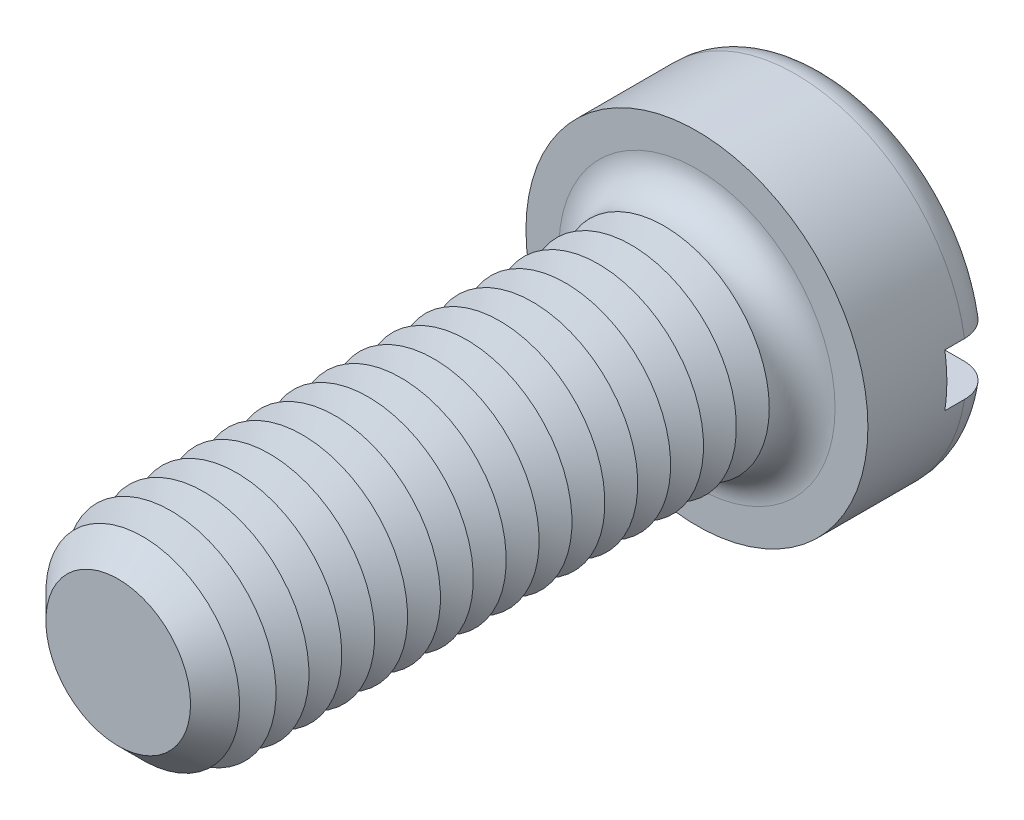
ISO-10303-21;
HEADER;
FILE_DESCRIPTION(('STEP AP214'),'2;1');
FILE_NAME('part.step','',(''),(''),'','','');
FILE_SCHEMA(('AUTOMOTIVE_DESIGN { 1 0 10303 214 1 1 1 1 }'));
ENDSEC;
DATA;
#1=APPLICATION_CONTEXT('core data for automotive mechanical design processes');
#2=APPLICATION_PROTOCOL_DEFINITION('international standard','automotive_design',2000,#1);
#3=PRODUCT_CONTEXT('',#1,'mechanical');
#4=PRODUCT('Part','Part','',(#3));
#5=PRODUCT_RELATED_PRODUCT_CATEGORY('part','',(#4));
#6=PRODUCT_DEFINITION_FORMATION('','',#4);
#7=PRODUCT_DEFINITION_CONTEXT('part definition',#1,'design');
#8=PRODUCT_DEFINITION('design','',#6,#7);
#9=PRODUCT_DEFINITION_SHAPE('','',#8);
#10=(LENGTH_UNIT() NAMED_UNIT(*) SI_UNIT(.MILLI.,.METRE.));
#11=(NAMED_UNIT(*) PLANE_ANGLE_UNIT() SI_UNIT($,.RADIAN.));
#12=(NAMED_UNIT(*) SI_UNIT($,.STERADIAN.) SOLID_ANGLE_UNIT());
#13=UNCERTAINTY_MEASURE_WITH_UNIT(LENGTH_MEASURE(1.E-05),#10,'distance_accuracy_value','');
#14=(GEOMETRIC_REPRESENTATION_CONTEXT(3) GLOBAL_UNCERTAINTY_ASSIGNED_CONTEXT((#13)) GLOBAL_UNIT_ASSIGNED_CONTEXT((#10,
#11,#12)) REPRESENTATION_CONTEXT('',''));
#15=CARTESIAN_POINT('',(0.,0.,0.));
#16=DIRECTION('',(0.,0.,1.));
#17=DIRECTION('',(1.,0.,0.));
#18=AXIS2_PLACEMENT_3D('',#15,#16,#17);
#19=CARTESIAN_POINT('',(0.,0.,-5.));
#20=DIRECTION('',(0.,0.,1.));
#21=DIRECTION('',(1.,0.,0.));
#22=AXIS2_PLACEMENT_3D('',#19,#20,#21);
#23=PLANE('',#22);
#24=CARTESIAN_POINT('',(0.,0.,-5.));
#25=DIRECTION('',(0.,0.,1.));
#26=DIRECTION('',(1.,0.,0.));
#27=AXIS2_PLACEMENT_3D('',#24,#25,#26);
#28=CIRCLE('',#27,5.25);
#29=CARTESIAN_POINT('',(-5.15388203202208,1.,-5.));
#30=VERTEX_POINT('',#29);
#31=CARTESIAN_POINT('',(5.15388203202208,1.,-5.));
#32=VERTEX_POINT('',#31);
#33=EDGE_CURVE('E116',#30,#32,#28,.F.);
#34=ORIENTED_EDGE('',*,*,#33,.T.);
#35=DIRECTION('',(1.,0.,0.));
#36=VECTOR('',#35,1.);
#37=CARTESIAN_POINT('',(-6.5,1.,-5.));
#38=LINE('',#37,#36);
#39=EDGE_CURVE('E111',#30,#32,#38,.T.);
#40=ORIENTED_EDGE('',*,*,#39,.F.);
#41=EDGE_LOOP('',(#34,#40));
#42=FACE_BOUND('',#41,.T.);
#43=ADVANCED_FACE('F39',(#42),#23,.F.);
#44=CARTESIAN_POINT('',(0.,0.,-3.75));
#45=DIRECTION('',(0.,0.,1.));
#46=DIRECTION('',(1.,0.,0.));
#47=AXIS2_PLACEMENT_3D('',#44,#45,#46);
#48=TOROIDAL_SURFACE('',#47,5.25,1.25);
#49=CARTESIAN_POINT('',(-6.04655789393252,1.,-4.63904490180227));
#50=CARTESIAN_POINT('',(-5.99546860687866,1.,-4.68885774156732));
#51=CARTESIAN_POINT('',(-5.94008472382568,1.,-4.73434760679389));
#52=CARTESIAN_POINT('',(-5.8223927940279,1.,-4.81538052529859));
#53=CARTESIAN_POINT('',(-5.7600753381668,1.,-4.85090982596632));
#54=CARTESIAN_POINT('',(-5.63044351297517,1.,-4.91100606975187));
#55=CARTESIAN_POINT('',(-5.56313479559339,1.,-4.93558519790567));
#56=CARTESIAN_POINT('',(-5.42539577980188,1.,-4.97322457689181));
#57=CARTESIAN_POINT('',(-5.35496625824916,1.,-4.98628767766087));
#58=CARTESIAN_POINT('',(-5.21212635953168,1.,-5.00070478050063));
#59=CARTESIAN_POINT('',(-5.13970265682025,1.,-5.00192674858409));
#60=CARTESIAN_POINT('',(-4.99565121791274,1.,-4.99234085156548));
#61=CARTESIAN_POINT('',(-4.92402357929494,1.,-4.98153152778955));
#62=CARTESIAN_POINT('',(-4.78274786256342,1.,-4.94801424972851));
#63=CARTESIAN_POINT('',(-4.71313137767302,1.,-4.92517296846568));
#64=CARTESIAN_POINT('',(-4.57871041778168,1.,-4.86813760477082));
#65=CARTESIAN_POINT('',(-4.51390612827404,1.,-4.83394308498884));
#66=CARTESIAN_POINT('',(-4.39095493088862,1.,-4.75508341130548));
#67=CARTESIAN_POINT('',(-4.33281197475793,1.,-4.7104120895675));
#68=CARTESIAN_POINT('',(-4.22499800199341,1.,-4.61179869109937));
#69=CARTESIAN_POINT('',(-4.17532640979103,1.,-4.55785724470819));
#70=CARTESIAN_POINT('',(-4.08677450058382,1.,-4.4431082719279));
#71=CARTESIAN_POINT('',(-4.0477350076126,1.,-4.38242369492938));
#72=CARTESIAN_POINT('',(-3.98074296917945,1.,-4.25521412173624));
#73=CARTESIAN_POINT('',(-3.95278836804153,1.,-4.18869021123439));
#74=CARTESIAN_POINT('',(-3.90959497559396,1.,-4.0537026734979));
#75=CARTESIAN_POINT('',(-3.89401985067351,1.,-3.98534663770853));
#76=CARTESIAN_POINT('',(-3.8748586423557,1.,-3.84697740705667));
#77=CARTESIAN_POINT('',(-3.87127067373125,1.,-3.7769644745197));
#78=CARTESIAN_POINT('',(-3.8761573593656,1.,-3.63892215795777));
#79=CARTESIAN_POINT('',(-3.88436651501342,1.,-3.57088319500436));
#80=CARTESIAN_POINT('',(-3.91207743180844,1.,-3.43714958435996));
#81=CARTESIAN_POINT('',(-3.93157911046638,1.,-3.37145491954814));
#82=CARTESIAN_POINT('',(-3.98125045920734,1.,-3.24411474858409));
#83=CARTESIAN_POINT('',(-4.01143761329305,1.,-3.18247607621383));
#84=CARTESIAN_POINT('',(-4.08150210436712,1.,-3.064981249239));
#85=CARTESIAN_POINT('',(-4.12138048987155,1.,-3.0091257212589));
#86=CARTESIAN_POINT('',(-4.2106718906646,1.,-2.90336353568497));
#87=CARTESIAN_POINT('',(-4.26028693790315,1.,-2.85362751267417));
#88=CARTESIAN_POINT('',(-4.36696587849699,1.,-2.76291710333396));
#89=CARTESIAN_POINT('',(-4.42403082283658,1.,-2.72194395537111));
#90=CARTESIAN_POINT('',(-4.54567957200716,1.,-2.64877280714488));
#91=CARTESIAN_POINT('',(-4.61042643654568,1.,-2.61684571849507));
#92=CARTESIAN_POINT('',(-4.74430563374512,1.,-2.56412359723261));
#93=CARTESIAN_POINT('',(-4.81343838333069,1.,-2.54332962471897));
#94=CARTESIAN_POINT('',(-4.95527237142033,1.,-2.51320471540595));
#95=CARTESIAN_POINT('',(-5.0280120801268,1.,-2.50405449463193));
#96=CARTESIAN_POINT('',(-5.17399775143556,1.,-2.49810126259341));
#97=CARTESIAN_POINT('',(-5.24724372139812,1.,-2.50129843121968));
#98=CARTESIAN_POINT('',(-5.3921014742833,1.,-2.52000776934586));
#99=CARTESIAN_POINT('',(-5.4637142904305,1.,-2.53551191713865));
#100=CARTESIAN_POINT('',(-5.60326680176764,1.,-2.57846304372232));
#101=CARTESIAN_POINT('',(-5.67120668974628,1.,-2.60590939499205));
#102=CARTESIAN_POINT('',(-5.80064060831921,1.,-2.67164926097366));
#103=CARTESIAN_POINT('',(-5.862199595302,1.,-2.7098148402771));
#104=CARTESIAN_POINT('',(-5.9779079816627,1.,-2.79608690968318));
#105=CARTESIAN_POINT('',(-6.03205795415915,1.,-2.84419263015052));
#106=CARTESIAN_POINT('',(-6.13055119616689,1.,-2.94820522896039));
#107=CARTESIAN_POINT('',(-6.17502887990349,1.,-3.00398483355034));
#108=CARTESIAN_POINT('',(-6.25384180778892,1.,-3.12230113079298));
#109=CARTESIAN_POINT('',(-6.28817779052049,1.,-3.18483733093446));
#110=CARTESIAN_POINT('',(-6.34527986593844,1.,-3.31401726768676));
#111=CARTESIAN_POINT('',(-6.36818984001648,1.,-3.38059742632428));
#112=CARTESIAN_POINT('',(-6.40240470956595,1.,-3.5166725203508));
#113=CARTESIAN_POINT('',(-6.41371067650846,1.,-3.58616718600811));
#114=CARTESIAN_POINT('',(-6.42433240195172,1.,-3.72550026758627));
#115=CARTESIAN_POINT('',(-6.4237441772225,1.,-3.79533138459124));
#116=CARTESIAN_POINT('',(-6.41082814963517,1.,-3.93391789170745));
#117=CARTESIAN_POINT('',(-6.39849757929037,1.,-4.00267302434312));
#118=CARTESIAN_POINT('',(-6.36249191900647,1.,-4.13704597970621));
#119=CARTESIAN_POINT('',(-6.33883072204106,1.,-4.20266753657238));
#120=CARTESIAN_POINT('',(-6.28088769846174,1.,-4.32897165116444));
#121=CARTESIAN_POINT('',(-6.24661890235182,1.,-4.38966015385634));
#122=CARTESIAN_POINT('',(-6.18404039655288,1.,-4.48163773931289));
#123=CARTESIAN_POINT('',(-6.15876600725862,1.,-4.51503333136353));
#124=CARTESIAN_POINT('',(-6.10500607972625,1.,-4.5791298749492));
#125=CARTESIAN_POINT('',(-6.07652056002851,1.,-4.60983084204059));
#126=CARTESIAN_POINT('',(-6.04655789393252,1.,-4.63904490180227));
#127=B_SPLINE_CURVE_WITH_KNOTS('',3,(#49,#50,#51,#52,#53,#54,#55,#56,#57,#58,#59,#60,#61,#62,
#63,#64,#65,#66,#67,#68,#69,#70,#71,#72,#73,#74,#75,#76,#77,#78,#79,#80,#81,#82,#83,#84,#85,#86,
#87,#88,#89,#90,#91,#92,#93,#94,#95,#96,#97,#98,#99,#100,#101,#102,#103,#104,#105,#106,#107,
#108,#109,#110,#111,#112,#113,#114,#115,#116,#117,#118,#119,#120,#121,#122,#123,#124,#125,#126),
.UNSPECIFIED.,.T.,.F.,(4,2,2,2,2,2,2,2,2,2,2,2,2,2,2,2,2,2,2,2,2,2,2,2,2,2,2,2,2,2,2,2,2,2,2,2,
2,2,4),(0.,0.213907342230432,0.428108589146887,0.642070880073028,0.855980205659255,
1.07227200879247,1.28859003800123,1.50735715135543,1.72613269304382,1.94503735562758,
2.16392713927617,2.37933295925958,2.59469881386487,2.80399176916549,3.01325180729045,
3.2178754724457,3.42249764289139,3.62745618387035,3.83243690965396,4.04223444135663,
4.25206160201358,4.46763253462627,4.68322399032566,4.90212226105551,5.12102372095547,
5.33978261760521,5.55853002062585,5.77477015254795,5.99099354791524,6.20398686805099,
6.41696467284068,6.62718821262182,6.83739233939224,7.0459002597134,7.25445733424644,
7.46275934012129,7.67080647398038,7.79625882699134,7.92171045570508),.UNSPECIFIED.);
#128=CARTESIAN_POINT('',(-6.42261628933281,1.,-3.74999999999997));
#129=VERTEX_POINT('',#128);
#130=EDGE_CURVE('E312',#129,#30,#127,.T.);
#131=ORIENTED_EDGE('',*,*,#130,.F.);
#132=CARTESIAN_POINT('',(0.,0.,-3.75));
#133=DIRECTION('',(0.,0.,1.));
#134=DIRECTION('',(1.,0.,0.));
#135=AXIS2_PLACEMENT_3D('',#132,#133,#134);
#136=CIRCLE('',#135,6.5);
#137=CARTESIAN_POINT('',(6.42261628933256,1.,-3.75));
#138=VERTEX_POINT('',#137);
#139=EDGE_CURVE('E124',#138,#129,#136,.T.);
#140=ORIENTED_EDGE('',*,*,#139,.F.);
#141=CARTESIAN_POINT('',(4.06944999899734,1.,-4.4133199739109));
#142=CARTESIAN_POINT('',(4.10828271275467,1.,-4.47354709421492));
#143=CARTESIAN_POINT('',(4.15233880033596,1.,-4.53047894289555));
#144=CARTESIAN_POINT('',(4.24946916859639,1.,-4.63614530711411));
#145=CARTESIAN_POINT('',(4.3025574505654,1.,-4.68486685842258));
#146=CARTESIAN_POINT('',(4.41603250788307,1.,-4.77271114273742));
#147=CARTESIAN_POINT('',(4.47640839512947,1.,-4.8118479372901));
#148=CARTESIAN_POINT('',(4.60277035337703,1.,-4.87959878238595));
#149=CARTESIAN_POINT('',(4.66875480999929,1.,-4.90821584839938));
#150=CARTESIAN_POINT('',(4.80558589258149,1.,-4.95456537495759));
#151=CARTESIAN_POINT('',(4.87649196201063,1.,-4.97212253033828));
#152=CARTESIAN_POINT('',(5.02024710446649,1.,-4.99514979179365));
#153=CARTESIAN_POINT('',(5.09309636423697,1.,-5.00061873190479));
#154=CARTESIAN_POINT('',(5.23902872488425,1.,-4.99926689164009));
#155=CARTESIAN_POINT('',(5.31211131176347,1.,-4.99238812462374));
#156=CARTESIAN_POINT('',(5.45605806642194,1.,-4.96635140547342));
#157=CARTESIAN_POINT('',(5.52692231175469,1.,-4.94719388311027));
#158=CARTESIAN_POINT('',(5.66376170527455,1.,-4.89728421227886));
#159=CARTESIAN_POINT('',(5.72977335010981,1.,-4.86663219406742));
#160=CARTESIAN_POINT('',(5.85560715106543,1.,-4.79452334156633));
#161=CARTESIAN_POINT('',(5.91542977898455,1.,-4.7530673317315));
#162=CARTESIAN_POINT('',(6.02626022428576,1.,-4.66116821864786));
#163=CARTESIAN_POINT('',(6.07738307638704,1.,-4.6108638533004));
#164=CARTESIAN_POINT('',(6.17030947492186,1.,-4.50227823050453));
#165=CARTESIAN_POINT('',(6.2121137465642,1.,-4.44399759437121));
#166=CARTESIAN_POINT('',(6.28460268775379,1.,-4.32200305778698));
#167=CARTESIAN_POINT('',(6.31543589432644,1.,-4.2583773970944));
#168=CARTESIAN_POINT('',(6.36586009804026,1.,-4.12681721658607));
#169=CARTESIAN_POINT('',(6.38545178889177,1.,-4.0588829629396));
#170=CARTESIAN_POINT('',(6.41265760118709,1.,-3.92136007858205));
#171=CARTESIAN_POINT('',(6.42038873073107,1.,-3.85179457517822));
#172=CARTESIAN_POINT('',(6.42401070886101,1.,-3.7123569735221));
#173=CARTESIAN_POINT('',(6.41990193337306,1.,-3.64248488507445));
#174=CARTESIAN_POINT('',(6.40000894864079,1.,-3.50470871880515));
#175=CARTESIAN_POINT('',(6.38427119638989,1.,-3.43679792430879));
#176=CARTESIAN_POINT('',(6.34164491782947,1.,-3.30457296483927));
#177=CARTESIAN_POINT('',(6.31475638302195,1.,-3.24025880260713));
#178=CARTESIAN_POINT('',(6.2505455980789,1.,-3.11686791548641));
#179=CARTESIAN_POINT('',(6.21319759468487,1.,-3.05780459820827));
#180=CARTESIAN_POINT('',(6.12919411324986,1.,-2.94671919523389));
#181=CARTESIAN_POINT('',(6.08253833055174,1.,-2.89469734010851));
#182=CARTESIAN_POINT('',(5.98083387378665,1.,-2.79868150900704));
#183=CARTESIAN_POINT('',(5.92571704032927,1.,-2.75475975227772));
#184=CARTESIAN_POINT('',(5.80897194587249,1.,-2.67665277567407));
#185=CARTESIAN_POINT('',(5.74734329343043,1.,-2.64246814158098));
#186=CARTESIAN_POINT('',(5.6184644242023,1.,-2.58431810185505));
#187=CARTESIAN_POINT('',(5.55115102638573,1.,-2.56049275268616));
#188=CARTESIAN_POINT('',(5.41351272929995,1.,-2.52429868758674));
#189=CARTESIAN_POINT('',(5.34318759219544,1.,-2.51193087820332));
#190=CARTESIAN_POINT('',(5.20041507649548,1.,-2.49882112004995));
#191=CARTESIAN_POINT('',(5.12795169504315,1.,-2.49825332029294));
#192=CARTESIAN_POINT('',(4.98393373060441,1.,-2.50914771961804));
#193=CARTESIAN_POINT('',(4.91237921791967,1.,-2.52061084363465));
#194=CARTESIAN_POINT('',(4.77137358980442,1.,-2.55542281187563));
#195=CARTESIAN_POINT('',(4.70195472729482,1.,-2.57890245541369));
#196=CARTESIAN_POINT('',(4.56803538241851,1.,-2.63717701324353));
#197=CARTESIAN_POINT('',(4.50353509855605,1.,-2.67197238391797));
#198=CARTESIAN_POINT('',(4.38131858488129,1.,-2.7519648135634));
#199=CARTESIAN_POINT('',(4.32360365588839,1.,-2.79716386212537));
#200=CARTESIAN_POINT('',(4.21673400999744,1.,-2.89675634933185));
#201=CARTESIAN_POINT('',(4.16757871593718,1.,-2.95114916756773));
#202=CARTESIAN_POINT('',(4.08014713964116,1.,-3.06667703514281));
#203=CARTESIAN_POINT('',(4.04170608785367,1.,-3.12768727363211));
#204=CARTESIAN_POINT('',(3.97596192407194,1.,-3.25543782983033));
#205=CARTESIAN_POINT('',(3.94865624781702,1.,-3.32217682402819));
#206=CARTESIAN_POINT('',(3.9067737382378,1.,-3.45745603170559));
#207=CARTESIAN_POINT('',(3.89185707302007,1.,-3.52589108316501));
#208=CARTESIAN_POINT('',(3.87400755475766,1.,-3.66432360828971));
#209=CARTESIAN_POINT('',(3.87107601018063,1.,-3.73432125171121));
#210=CARTESIAN_POINT('',(3.8772387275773,1.,-3.87228267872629));
#211=CARTESIAN_POINT('',(3.88607933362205,1.,-3.94025811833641));
#212=CARTESIAN_POINT('',(3.91502769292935,1.,-4.07370133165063));
#213=CARTESIAN_POINT('',(3.93512131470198,1.,-4.1391721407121));
#214=CARTESIAN_POINT('',(3.9752037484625,1.,-4.23926719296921));
#215=CARTESIAN_POINT('',(3.99171171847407,1.,-4.27532618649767));
#216=CARTESIAN_POINT('',(4.02809737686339,1.,-4.34569933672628));
#217=CARTESIAN_POINT('',(4.04797497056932,1.,-4.3800135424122));
#218=CARTESIAN_POINT('',(4.06944999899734,1.,-4.4133199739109));
#219=B_SPLINE_CURVE_WITH_KNOTS('',3,(#141,#142,#143,#144,#145,#146,#147,#148,#149,#150,#151,
#152,#153,#154,#155,#156,#157,#158,#159,#160,#161,#162,#163,#164,#165,#166,#167,#168,#169,#170,
#171,#172,#173,#174,#175,#176,#177,#178,#179,#180,#181,#182,#183,#184,#185,#186,#187,#188,#189,
#190,#191,#192,#193,#194,#195,#196,#197,#198,#199,#200,#201,#202,#203,#204,#205,#206,#207,#208,
#209,#210,#211,#212,#213,#214,#215,#216,#217,#218),.UNSPECIFIED.,.T.,.F.,(4,2,2,2,2,2,2,2,2,2,2,
2,2,2,2,2,2,2,2,2,2,2,2,2,2,2,2,2,2,2,2,2,2,2,2,2,2,2,4),(0.,0.214833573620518,
0.430003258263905,0.644855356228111,0.859645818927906,1.0777603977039,1.29589601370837,
1.51505870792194,1.73421373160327,1.95150241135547,2.16877451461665,2.38290237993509,
2.59701357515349,2.8081044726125,3.01918234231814,3.22816416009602,3.43713934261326,
3.64528416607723,3.85342914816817,4.06209119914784,4.27076008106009,4.48120788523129,
4.69166834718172,4.90489186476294,5.11813225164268,5.33451752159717,5.55091942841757,
5.76972860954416,5.98854661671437,6.20740650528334,6.42625163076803,6.64151774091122,
6.85673425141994,7.0658317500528,7.27495207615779,7.47963858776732,7.68406862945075,
7.80287790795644,7.92168384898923),.UNSPECIFIED.);
#220=EDGE_CURVE('E314',#32,#138,#219,.T.);
#221=ORIENTED_EDGE('',*,*,#220,.F.);
#222=ORIENTED_EDGE('',*,*,#33,.F.);
#223=EDGE_LOOP('',(#131,#140,#221,#222));
#224=FACE_BOUND('',#223,.T.);
#225=ADVANCED_FACE('F296',(#224),#48,.T.);
#226=CARTESIAN_POINT('',(0.,0.,-5.));
#227=DIRECTION('',(0.,0.,1.));
#228=DIRECTION('',(1.,0.,0.));
#229=AXIS2_PLACEMENT_3D('',#226,#227,#228);
#230=CYLINDRICAL_SURFACE('',#229,6.5);
#231=DIRECTION('',(0.,0.,1.));
#232=VECTOR('',#231,1.);
#233=CARTESIAN_POINT('',(6.42261628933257,1.,-5.));
#234=LINE('',#233,#232);
#235=CARTESIAN_POINT('',(6.42261628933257,1.,-3.));
#236=VERTEX_POINT('',#235);
#237=EDGE_CURVE('E329',#138,#236,#234,.T.);
#238=ORIENTED_EDGE('',*,*,#237,.F.);
#239=ORIENTED_EDGE('',*,*,#139,.T.);
#240=DIRECTION('',(0.,0.,1.));
#241=VECTOR('',#240,1.);
#242=CARTESIAN_POINT('',(-6.42261628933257,1.,-5.));
#243=LINE('',#242,#241);
#244=CARTESIAN_POINT('',(-6.42261628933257,1.,-3.));
#245=VERTEX_POINT('',#244);
#246=EDGE_CURVE('E63',#245,#129,#243,.F.);
#247=ORIENTED_EDGE('',*,*,#246,.F.);
#248=CARTESIAN_POINT('',(0.,0.,-3.));
#249=DIRECTION('',(0.,0.,-1.));
#250=DIRECTION('',(-1.,0.,0.));
#251=AXIS2_PLACEMENT_3D('',#248,#249,#250);
#252=CIRCLE('',#251,6.5);
#253=CARTESIAN_POINT('',(-6.42261628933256,-0.999999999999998,-3.));
#254=VERTEX_POINT('',#253);
#255=EDGE_CURVE('E43',#245,#254,#252,.F.);
#256=ORIENTED_EDGE('',*,*,#255,.T.);
#257=DIRECTION('',(0.,0.,1.));
#258=VECTOR('',#257,1.);
#259=CARTESIAN_POINT('',(-6.42261628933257,-0.999999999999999,-5.));
#260=LINE('',#259,#258);
#261=CARTESIAN_POINT('',(-6.42261628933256,-0.999999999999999,-3.75));
#262=VERTEX_POINT('',#261);
#263=EDGE_CURVE('E326',#262,#254,#260,.T.);
#264=ORIENTED_EDGE('',*,*,#263,.F.);
#265=CARTESIAN_POINT('',(6.42261628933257,-1.,-3.75));
#266=VERTEX_POINT('',#265);
#267=EDGE_CURVE('E126',#262,#266,#136,.T.);
#268=ORIENTED_EDGE('',*,*,#267,.T.);
#269=DIRECTION('',(0.,0.,1.));
#270=VECTOR('',#269,1.);
#271=CARTESIAN_POINT('',(6.42261628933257,-1.,-5.));
#272=LINE('',#271,#270);
#273=CARTESIAN_POINT('',(6.42261628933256,-1.,-3.));
#274=VERTEX_POINT('',#273);
#275=EDGE_CURVE('E55',#274,#266,#272,.F.);
#276=ORIENTED_EDGE('',*,*,#275,.F.);
#277=EDGE_CURVE('E11',#274,#236,#252,.F.);
#278=ORIENTED_EDGE('',*,*,#277,.T.);
#279=EDGE_LOOP('',(#238,#239,#247,#256,#264,#268,#276,#278));
#280=FACE_BOUND('',#279,.T.);
#281=CARTESIAN_POINT('',(0.,0.,0.));
#282=DIRECTION('',(0.,0.,1.));
#283=DIRECTION('',(1.,0.,0.));
#284=AXIS2_PLACEMENT_3D('',#281,#282,#283);
#285=CIRCLE('',#284,6.5);
#286=CARTESIAN_POINT('',(6.5,0.,0.));
#287=VERTEX_POINT('',#286);
#288=EDGE_CURVE('E332',#287,#287,#285,.T.);
#289=ORIENTED_EDGE('',*,*,#288,.F.);
#290=EDGE_LOOP('',(#289));
#291=FACE_BOUND('',#290,.T.);
#292=ADVANCED_FACE('F292',(#280,#291),#230,.T.);
#293=CARTESIAN_POINT('',(5.15388203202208,-1.,-5.));
#294=VERTEX_POINT('',#293);
#295=CARTESIAN_POINT('',(-5.15388203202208,-0.999999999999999,-5.));
#296=VERTEX_POINT('',#295);
#297=EDGE_CURVE('E109',#294,#296,#28,.F.);
#298=ORIENTED_EDGE('',*,*,#297,.T.);
#299=DIRECTION('',(-1.,0.,0.));
#300=VECTOR('',#299,1.);
#301=CARTESIAN_POINT('',(-6.5,-0.999999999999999,-5.));
#302=LINE('',#301,#300);
#303=EDGE_CURVE('E96',#294,#296,#302,.T.);
#304=ORIENTED_EDGE('',*,*,#303,.F.);
#305=EDGE_LOOP('',(#298,#304));
#306=FACE_BOUND('',#305,.T.);
#307=ADVANCED_FACE('F108',(#306),#23,.F.);
#308=CARTESIAN_POINT('',(0.,0.,0.));
#309=DIRECTION('',(0.,0.,1.));
#310=DIRECTION('',(1.,0.,0.));
#311=AXIS2_PLACEMENT_3D('',#308,#309,#310);
#312=PLANE('',#311);
#313=CARTESIAN_POINT('',(0.,0.,0.));
#314=DIRECTION('',(0.,0.,1.));
#315=DIRECTION('',(1.,0.,0.));
#316=AXIS2_PLACEMENT_3D('',#313,#314,#315);
#317=CIRCLE('',#316,5.25);
#318=CARTESIAN_POINT('',(5.25,0.,0.));
#319=VERTEX_POINT('',#318);
#320=EDGE_CURVE('E115',#319,#319,#317,.F.);
#321=ORIENTED_EDGE('',*,*,#320,.T.);
#322=EDGE_LOOP('',(#321));
#323=FACE_BOUND('',#322,.T.);
#324=ORIENTED_EDGE('',*,*,#288,.T.);
#325=EDGE_LOOP('',(#324));
#326=FACE_BOUND('',#325,.T.);
#327=ADVANCED_FACE('F291',(#323,#326),#312,.T.);
#328=CARTESIAN_POINT('',(-6.04655789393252,-0.999999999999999,-4.63904490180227));
#329=CARTESIAN_POINT('',(-6.0966604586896,-0.999999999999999,-4.59018532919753));
#330=CARTESIAN_POINT('',(-6.14270501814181,-0.999999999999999,-4.53709744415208));
#331=CARTESIAN_POINT('',(-6.22528519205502,-0.999999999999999,-4.42391631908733));
#332=CARTESIAN_POINT('',(-6.26181074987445,-0.999999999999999,-4.36381576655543));
#333=CARTESIAN_POINT('',(-6.32422109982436,-0.999999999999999,-4.23831836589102));
#334=CARTESIAN_POINT('',(-6.35010658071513,-0.999999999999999,-4.17292186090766));
#335=CARTESIAN_POINT('',(-6.39044668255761,-0.999999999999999,-4.03870925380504));
#336=CARTESIAN_POINT('',(-6.40490396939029,-0.999999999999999,-3.96989395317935));
#337=CARTESIAN_POINT('',(-6.42190814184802,-0.999999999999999,-3.83122595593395));
#338=CARTESIAN_POINT('',(-6.4245257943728,-0.999999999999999,-3.76138193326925));
#339=CARTESIAN_POINT('',(-6.41796432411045,-0.999999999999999,-3.62224935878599));
#340=CARTESIAN_POINT('',(-6.40878509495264,-0.999999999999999,-3.55296081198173));
#341=CARTESIAN_POINT('',(-6.37894560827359,-0.999999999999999,-3.41709241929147));
#342=CARTESIAN_POINT('',(-6.35831520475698,-0.999999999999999,-3.35050601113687));
#343=CARTESIAN_POINT('',(-6.30620980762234,-0.999999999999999,-3.22172312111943));
#344=CARTESIAN_POINT('',(-6.2747347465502,-0.999999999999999,-3.15952666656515));
#345=CARTESIAN_POINT('',(-6.20172710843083,-0.999999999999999,-3.04101762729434));
#346=CARTESIAN_POINT('',(-6.16015622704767,-0.999999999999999,-2.98472864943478));
#347=CARTESIAN_POINT('',(-6.06823774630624,-0.999999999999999,-2.87984578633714));
#348=CARTESIAN_POINT('',(-6.01788981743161,-0.999999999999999,-2.83125219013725));
#349=CARTESIAN_POINT('',(-5.90933830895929,-0.999999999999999,-2.74262118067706));
#350=CARTESIAN_POINT('',(-5.85106338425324,-0.999999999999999,-2.70267117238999));
#351=CARTESIAN_POINT('',(-5.72870702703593,-0.999999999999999,-2.63296796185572));
#352=CARTESIAN_POINT('',(-5.66462521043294,-0.999999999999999,-2.6032154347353));
#353=CARTESIAN_POINT('',(-5.53153273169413,-0.999999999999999,-2.55430842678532));
#354=CARTESIAN_POINT('',(-5.46246626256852,-0.999999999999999,-2.53530583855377));
#355=CARTESIAN_POINT('',(-5.32214267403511,-0.999999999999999,-2.5089831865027));
#356=CARTESIAN_POINT('',(-5.25088537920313,-0.999999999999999,-2.50166406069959));
#357=CARTESIAN_POINT('',(-5.10710123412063,-0.999999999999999,-2.49882202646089));
#358=CARTESIAN_POINT('',(-5.03457095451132,-0.999999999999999,-2.50347166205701));
#359=CARTESIAN_POINT('',(-4.8912897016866,-0.999999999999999,-2.52476029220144));
#360=CARTESIAN_POINT('',(-4.82053886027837,-0.999999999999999,-2.54140017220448));
#361=CARTESIAN_POINT('',(-4.68213257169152,-0.999999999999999,-2.58641614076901));
#362=CARTESIAN_POINT('',(-4.61451256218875,-0.999999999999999,-2.61490131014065));
#363=CARTESIAN_POINT('',(-4.48502801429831,-0.999999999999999,-2.68285095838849));
#364=CARTESIAN_POINT('',(-4.42316359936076,-0.999999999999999,-2.72231567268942));
#365=CARTESIAN_POINT('',(-4.30720694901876,-0.999999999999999,-2.81103994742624));
#366=CARTESIAN_POINT('',(-4.25309118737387,-0.999999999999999,-2.86026872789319));
#367=CARTESIAN_POINT('',(-4.15409408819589,-0.999999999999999,-2.9672764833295));
#368=CARTESIAN_POINT('',(-4.10921182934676,-0.999999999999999,-3.02505460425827));
#369=CARTESIAN_POINT('',(-4.03096584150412,-0.999999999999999,-3.14632492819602));
#370=CARTESIAN_POINT('',(-3.99739097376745,-0.999999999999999,-3.2096807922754));
#371=CARTESIAN_POINT('',(-3.94171839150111,-0.999999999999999,-3.34124912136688));
#372=CARTESIAN_POINT('',(-3.91961840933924,-0.999999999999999,-3.40946062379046));
#373=CARTESIAN_POINT('',(-3.88816636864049,-0.999999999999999,-3.54669256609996));
#374=CARTESIAN_POINT('',(-3.87846562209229,-0.999999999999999,-3.61563318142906));
#375=CARTESIAN_POINT('',(-3.87100568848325,-0.999999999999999,-3.75415397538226));
#376=CARTESIAN_POINT('',(-3.87324501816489,-0.999999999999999,-3.82373407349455));
#377=CARTESIAN_POINT('',(-3.88943589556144,-0.999999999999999,-3.96027701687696));
#378=CARTESIAN_POINT('',(-3.90318225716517,-0.999999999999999,-4.0272643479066));
#379=CARTESIAN_POINT('',(-3.94163954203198,-0.999999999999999,-4.1580093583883));
#380=CARTESIAN_POINT('',(-3.96635075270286,-0.999999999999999,-4.22176695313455));
#381=CARTESIAN_POINT('',(-4.026160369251,-0.999999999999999,-4.34483320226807));
#382=CARTESIAN_POINT('',(-4.06134035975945,-0.999999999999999,-4.40410214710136));
#383=CARTESIAN_POINT('',(-4.14090865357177,-0.999999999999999,-4.51609417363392));
#384=CARTESIAN_POINT('',(-4.18529811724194,-0.999999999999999,-4.56881642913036));
#385=CARTESIAN_POINT('',(-4.2832649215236,-0.999999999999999,-4.66770177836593));
#386=CARTESIAN_POINT('',(-4.33705327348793,-0.999999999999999,-4.71365579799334));
#387=CARTESIAN_POINT('',(-4.45141776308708,-0.999999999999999,-4.79615385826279));
#388=CARTESIAN_POINT('',(-4.51199483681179,-0.999999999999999,-4.83269659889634));
#389=CARTESIAN_POINT('',(-4.63989216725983,-0.999999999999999,-4.89626962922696));
#390=CARTESIAN_POINT('',(-4.70734508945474,-0.999999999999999,-4.92303326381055));
#391=CARTESIAN_POINT('',(-4.84575497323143,-0.999999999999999,-4.96500199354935));
#392=CARTESIAN_POINT('',(-4.91671207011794,-0.999999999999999,-4.98020664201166));
#393=CARTESIAN_POINT('',(-5.06097761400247,-0.999999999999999,-4.9987306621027));
#394=CARTESIAN_POINT('',(-5.13430353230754,-0.999999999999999,-5.00191441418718));
#395=CARTESIAN_POINT('',(-5.28046546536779,-0.999999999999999,-4.99587686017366));
#396=CARTESIAN_POINT('',(-5.35330135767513,-0.999999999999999,-4.98665256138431));
#397=CARTESIAN_POINT('',(-5.49610354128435,-0.999999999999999,-4.95604184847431));
#398=CARTESIAN_POINT('',(-5.56607890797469,-0.999999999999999,-4.93469772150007));
#399=CARTESIAN_POINT('',(-5.70131538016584,-0.999999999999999,-4.88041956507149));
#400=CARTESIAN_POINT('',(-5.76658233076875,-0.999999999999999,-4.84750021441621));
#401=CARTESIAN_POINT('',(-5.86782577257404,-0.999999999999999,-4.78498748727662));
#402=CARTESIAN_POINT('',(-5.90579749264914,-0.999999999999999,-4.75856648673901));
#403=CARTESIAN_POINT('',(-5.97862186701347,-0.999999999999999,-4.70172646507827));
#404=CARTESIAN_POINT('',(-6.0134745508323,-0.999999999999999,-4.6713074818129));
#405=CARTESIAN_POINT('',(-6.04655789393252,-0.999999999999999,-4.63904490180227));
#406=B_SPLINE_CURVE_WITH_KNOTS('',3,(#328,#329,#330,#331,#332,#333,#334,#335,#336,#337,#338,
#339,#340,#341,#342,#343,#344,#345,#346,#347,#348,#349,#350,#351,#352,#353,#354,#355,#356,#357,
#358,#359,#360,#361,#362,#363,#364,#365,#366,#367,#368,#369,#370,#371,#372,#373,#374,#375,#376,
#377,#378,#379,#380,#381,#382,#383,#384,#385,#386,#387,#388,#389,#390,#391,#392,#393,#394,#395,
#396,#397,#398,#399,#400,#401,#402,#403,#404,#405),.UNSPECIFIED.,.T.,.F.,(4,2,2,2,2,2,2,2,2,2,2,
2,2,2,2,2,2,2,2,2,2,2,2,2,2,2,2,2,2,2,2,2,2,2,2,2,2,2,4),(0.,0.209780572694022,
0.419781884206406,0.629769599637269,0.839708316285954,1.04839053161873,1.2570746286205,
1.46521720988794,1.67336108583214,1.88230736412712,2.09126148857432,2.30223890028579,
2.51323027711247,2.72713284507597,2.94105258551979,3.15807345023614,3.37511034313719,
3.59419176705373,3.81327788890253,4.03168404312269,4.25006839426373,4.46411376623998,
4.67811682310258,4.88595885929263,5.09377507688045,5.29796268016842,5.50215563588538,
5.70798353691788,5.91383738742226,6.12510741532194,6.33640661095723,6.55309998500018,
6.76980173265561,6.98894112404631,7.20813337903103,7.42656551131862,7.64472163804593,
7.78324365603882,7.92176436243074),.UNSPECIFIED.);
#407=EDGE_CURVE('E103',#296,#262,#406,.T.);
#408=ORIENTED_EDGE('',*,*,#407,.F.);
#409=ORIENTED_EDGE('',*,*,#297,.F.);
#410=CARTESIAN_POINT('',(4.06944999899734,-1.,-4.4133199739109));
#411=CARTESIAN_POINT('',(4.03213207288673,-1.,-4.3554312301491));
#412=CARTESIAN_POINT('',(3.9995849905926,-1.,-4.29441722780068));
#413=CARTESIAN_POINT('',(3.94511822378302,-1.,-4.16776604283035));
#414=CARTESIAN_POINT('',(3.92320762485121,-1.,-4.10212496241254));
#415=CARTESIAN_POINT('',(3.89078811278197,-1.,-3.96804412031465));
#416=CARTESIAN_POINT('',(3.88028409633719,-1.,-3.89960316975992));
#417=CARTESIAN_POINT('',(3.87107895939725,-1.,-3.76194650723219));
#418=CARTESIAN_POINT('',(3.87237511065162,-1.,-3.69273097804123));
#419=CARTESIAN_POINT('',(3.88662927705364,-1.,-3.55634460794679));
#420=CARTESIAN_POINT('',(3.89944923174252,-1.,-3.48915926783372));
#421=CARTESIAN_POINT('',(3.93611188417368,-1.,-3.35786953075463));
#422=CARTESIAN_POINT('',(3.95995518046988,-1.,-3.29376530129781));
#423=CARTESIAN_POINT('',(4.0180748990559,-1.,-3.16993562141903));
#424=CARTESIAN_POINT('',(4.05242297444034,-1.,-3.11024385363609));
#425=CARTESIAN_POINT('',(4.13041121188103,-1.,-2.9972793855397));
#426=CARTESIAN_POINT('',(4.17405248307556,-1.,-2.94400745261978));
#427=CARTESIAN_POINT('',(4.27058636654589,-1.,-2.8439150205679));
#428=CARTESIAN_POINT('',(4.32368948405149,-1.,-2.79729757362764));
#429=CARTESIAN_POINT('',(4.43679856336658,-1.,-2.71336600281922));
#430=CARTESIAN_POINT('',(4.49680546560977,-1.,-2.67605314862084));
#431=CARTESIAN_POINT('',(4.62370121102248,-1.,-2.61081752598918));
#432=CARTESIAN_POINT('',(4.69072799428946,-1.,-2.58316284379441));
#433=CARTESIAN_POINT('',(4.82843981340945,-1.,-2.5393441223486));
#434=CARTESIAN_POINT('',(4.899125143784,-1.,-2.52318100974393));
#435=CARTESIAN_POINT('',(5.04306377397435,-1.,-2.50267755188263));
#436=CARTESIAN_POINT('',(5.11633773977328,-1.,-2.49848181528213));
#437=CARTESIAN_POINT('',(5.26254809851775,-1.,-2.50249357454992));
#438=CARTESIAN_POINT('',(5.33548449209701,-1.,-2.51070104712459));
#439=CARTESIAN_POINT('',(5.4786703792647,-1.,-2.53930888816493));
#440=CARTESIAN_POINT('',(5.54892819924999,-1.,-2.5596675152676));
#441=CARTESIAN_POINT('',(5.68495799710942,-1.,-2.61204238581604));
#442=CARTESIAN_POINT('',(5.75073024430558,-1.,-2.64405792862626));
#443=CARTESIAN_POINT('',(5.8750178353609,-1.,-2.7184150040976));
#444=CARTESIAN_POINT('',(5.93361487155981,-1.,-2.76061995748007));
#445=CARTESIAN_POINT('',(6.04275377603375,-1.,-2.85440601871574));
#446=CARTESIAN_POINT('',(6.09329629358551,-1.,-2.90598637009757));
#447=CARTESIAN_POINT('',(6.18409572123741,-1.,-3.01622977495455));
#448=CARTESIAN_POINT('',(6.2244945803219,-1.,-3.07477592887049));
#449=CARTESIAN_POINT('',(6.29474798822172,-1.,-3.19788594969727));
#450=CARTESIAN_POINT('',(6.3246032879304,-1.,-3.26244938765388));
#451=CARTESIAN_POINT('',(6.37256001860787,-1.,-3.39491634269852));
#452=CARTESIAN_POINT('',(6.39079949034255,-1.,-3.46276990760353));
#453=CARTESIAN_POINT('',(6.41554133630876,-1.,-3.60058363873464));
#454=CARTESIAN_POINT('',(6.42204424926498,-1.,-3.67054370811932));
#455=CARTESIAN_POINT('',(6.42311237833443,-1.,-3.81007982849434));
#456=CARTESIAN_POINT('',(6.41775799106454,-1.,-3.879655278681));
#457=CARTESIAN_POINT('',(6.39543799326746,-1.,-4.01691664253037));
#458=CARTESIAN_POINT('',(6.3784725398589,-1.,-4.08460258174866));
#459=CARTESIAN_POINT('',(6.33344768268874,-1.,-4.21614537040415));
#460=CARTESIAN_POINT('',(6.30539273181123,-1.,-4.28000374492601));
#461=CARTESIAN_POINT('',(6.23902076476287,-1.,-4.40214140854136));
#462=CARTESIAN_POINT('',(6.20070356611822,-1.,-4.46042059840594));
#463=CARTESIAN_POINT('',(6.11467174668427,-1.,-4.5701315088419));
#464=CARTESIAN_POINT('',(6.06690270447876,-1.,-4.62152053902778));
#465=CARTESIAN_POINT('',(5.96350111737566,-1.,-4.715657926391));
#466=CARTESIAN_POINT('',(5.90786817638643,-1.,-4.75840584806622));
#467=CARTESIAN_POINT('',(5.78965380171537,-1.,-4.8345781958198));
#468=CARTESIAN_POINT('',(5.72700078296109,-1.,-4.86789149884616));
#469=CARTESIAN_POINT('',(5.59704977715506,-1.,-4.92369754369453));
#470=CARTESIAN_POINT('',(5.52975144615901,-1.,-4.94618948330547));
#471=CARTESIAN_POINT('',(5.39137621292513,-1.,-4.98006173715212));
#472=CARTESIAN_POINT('',(5.32025859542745,-1.,-4.99127571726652));
#473=CARTESIAN_POINT('',(5.17715081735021,-1.,-5.00177798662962));
#474=CARTESIAN_POINT('',(5.10516061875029,-1.,-5.00106575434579));
#475=CARTESIAN_POINT('',(4.96131924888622,-1.,-4.98769775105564));
#476=CARTESIAN_POINT('',(4.88948297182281,-1.,-4.97488146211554));
#477=CARTESIAN_POINT('',(4.74893184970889,-1.,-4.93744335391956));
#478=CARTESIAN_POINT('',(4.68021795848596,-1.,-4.91281795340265));
#479=CARTESIAN_POINT('',(4.54744428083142,-1.,-4.8522329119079));
#480=CARTESIAN_POINT('',(4.48341761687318,-1.,-4.81620070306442));
#481=CARTESIAN_POINT('',(4.36244497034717,-1.,-4.73383277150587));
#482=CARTESIAN_POINT('',(4.30549069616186,-1.,-4.68750929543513));
#483=CARTESIAN_POINT('',(4.21823158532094,-1.,-4.60311228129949));
#484=CARTESIAN_POINT('',(4.18544074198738,-1.,-4.56757118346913));
#485=CARTESIAN_POINT('',(4.12413461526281,-1.,-4.49297229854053));
#486=CARTESIAN_POINT('',(4.09561926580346,-1.,-4.45391456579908));
#487=CARTESIAN_POINT('',(4.06944999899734,-1.,-4.4133199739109));
#488=B_SPLINE_CURVE_WITH_KNOTS('',3,(#410,#411,#412,#413,#414,#415,#416,#417,#418,#419,#420,
#421,#422,#423,#424,#425,#426,#427,#428,#429,#430,#431,#432,#433,#434,#435,#436,#437,#438,#439,
#440,#441,#442,#443,#444,#445,#446,#447,#448,#449,#450,#451,#452,#453,#454,#455,#456,#457,#458,
#459,#460,#461,#462,#463,#464,#465,#466,#467,#468,#469,#470,#471,#472,#473,#474,#475,#476,#477,
#478,#479,#480,#481,#482,#483,#484,#485,#486,#487),.UNSPECIFIED.,.T.,.F.,(4,2,2,2,2,2,2,2,2,2,2,
2,2,2,2,2,2,2,2,2,2,2,2,2,2,2,2,2,2,2,2,2,2,2,2,2,2,2,4),(0.,0.206453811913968,0.4130836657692,
0.619802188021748,0.826472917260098,1.03070015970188,1.23493849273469,1.44060223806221,
1.64629054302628,1.85731119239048,2.06836062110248,2.28487349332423,2.5014038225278,
2.72053974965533,2.9396752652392,3.15806230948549,3.37643622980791,3.59203140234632,
3.80760918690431,4.01997696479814,4.23232961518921,4.44210913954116,4.65187903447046,
4.86023097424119,5.06858009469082,5.27684563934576,5.48511488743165,5.69462015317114,
5.90413597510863,6.11602561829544,6.32793096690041,6.54291770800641,6.75791385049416,
6.97580180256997,7.19375587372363,7.41312537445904,7.63223520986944,7.77701357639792,
7.92178970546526),.UNSPECIFIED.);
#489=EDGE_CURVE('E92',#266,#294,#488,.T.);
#490=ORIENTED_EDGE('',*,*,#489,.F.);
#491=ORIENTED_EDGE('',*,*,#267,.F.);
#492=EDGE_LOOP('',(#408,#409,#490,#491));
#493=FACE_BOUND('',#492,.T.);
#494=ADVANCED_FACE('F113',(#493),#48,.T.);
#495=CARTESIAN_POINT('',(0.,0.,1.25));
#496=DIRECTION('',(0.,0.,1.));
#497=DIRECTION('',(1.,0.,0.));
#498=AXIS2_PLACEMENT_3D('',#495,#496,#497);
#499=TOROIDAL_SURFACE('',#498,5.25,1.25);
#500=ORIENTED_EDGE('',*,*,#320,.F.);
#501=EDGE_LOOP('',(#500));
#502=FACE_BOUND('',#501,.T.);
#503=CARTESIAN_POINT('',(0.,0.,1.25));
#504=DIRECTION('',(0.,0.,-1.));
#505=DIRECTION('',(-1.,0.,0.));
#506=AXIS2_PLACEMENT_3D('',#503,#504,#505);
#507=CIRCLE('',#506,4.);
#508=CARTESIAN_POINT('',(-4.,0.,1.25));
#509=VERTEX_POINT('',#508);
#510=EDGE_CURVE('E337',#509,#509,#507,.T.);
#511=ORIENTED_EDGE('',*,*,#510,.T.);
#512=EDGE_LOOP('',(#511));
#513=FACE_BOUND('',#512,.T.);
#514=ADVANCED_FACE('F284',(#502,#513),#499,.F.);
#515=CARTESIAN_POINT('',(0.,0.,1.875));
#516=DIRECTION('',(0.,0.,-1.));
#517=DIRECTION('',(-1.,0.,0.));
#518=AXIS2_PLACEMENT_3D('',#515,#516,#517);
#519=CONICAL_SURFACE('',#518,2.91746824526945,1.0471975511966);
#520=ORIENTED_EDGE('',*,*,#510,.F.);
#521=EDGE_LOOP('',(#520));
#522=FACE_BOUND('',#521,.T.);
#523=CARTESIAN_POINT('',(0.,0.,1.875));
#524=DIRECTION('',(0.,0.,-1.));
#525=DIRECTION('',(-1.,0.,0.));
#526=AXIS2_PLACEMENT_3D('',#523,#524,#525);
#527=CIRCLE('',#526,2.91746824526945);
#528=CARTESIAN_POINT('',(-2.91746824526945,0.,1.875));
#529=VERTEX_POINT('',#528);
#530=EDGE_CURVE('E343',#529,#529,#527,.T.);
#531=ORIENTED_EDGE('',*,*,#530,.T.);
#532=EDGE_LOOP('',(#531));
#533=FACE_BOUND('',#532,.T.);
#534=ADVANCED_FACE('F280',(#522,#533),#519,.T.);
#535=CARTESIAN_POINT('',(0.,0.,2.5));
#536=DIRECTION('',(0.,0.,1.));
#537=DIRECTION('',(1.,0.,0.));
#538=AXIS2_PLACEMENT_3D('',#535,#536,#537);
#539=CONICAL_SURFACE('',#538,4.,1.0471975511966);
#540=ORIENTED_EDGE('',*,*,#530,.F.);
#541=EDGE_LOOP('',(#540));
#542=FACE_BOUND('',#541,.T.);
#543=CARTESIAN_POINT('',(0.,0.,2.5));
#544=DIRECTION('',(0.,0.,-1.));
#545=DIRECTION('',(-1.,0.,0.));
#546=AXIS2_PLACEMENT_3D('',#543,#544,#545);
#547=CIRCLE('',#546,4.);
#548=CARTESIAN_POINT('',(-4.,0.,2.5));
#549=VERTEX_POINT('',#548);
#550=EDGE_CURVE('E348',#549,#549,#547,.T.);
#551=ORIENTED_EDGE('',*,*,#550,.T.);
#552=EDGE_LOOP('',(#551));
#553=FACE_BOUND('',#552,.T.);
#554=ADVANCED_FACE('F276',(#542,#553),#539,.T.);
#555=CARTESIAN_POINT('',(0.,0.,3.125));
#556=DIRECTION('',(0.,0.,-1.));
#557=DIRECTION('',(-1.,0.,0.));
#558=AXIS2_PLACEMENT_3D('',#555,#556,#557);
#559=CONICAL_SURFACE('',#558,2.91746824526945,1.0471975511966);
#560=ORIENTED_EDGE('',*,*,#550,.F.);
#561=EDGE_LOOP('',(#560));
#562=FACE_BOUND('',#561,.T.);
#563=CARTESIAN_POINT('',(0.,0.,3.125));
#564=DIRECTION('',(0.,0.,-1.));
#565=DIRECTION('',(-1.,0.,0.));
#566=AXIS2_PLACEMENT_3D('',#563,#564,#565);
#567=CIRCLE('',#566,2.91746824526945);
#568=CARTESIAN_POINT('',(-2.91746824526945,0.,3.125));
#569=VERTEX_POINT('',#568);
#570=EDGE_CURVE('E352',#569,#569,#567,.T.);
#571=ORIENTED_EDGE('',*,*,#570,.T.);
#572=EDGE_LOOP('',(#571));
#573=FACE_BOUND('',#572,.T.);
#574=ADVANCED_FACE('F272',(#562,#573),#559,.T.);
#575=CARTESIAN_POINT('',(0.,0.,3.75));
#576=DIRECTION('',(0.,0.,1.));
#577=DIRECTION('',(1.,0.,0.));
#578=AXIS2_PLACEMENT_3D('',#575,#576,#577);
#579=CONICAL_SURFACE('',#578,4.,1.0471975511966);
#580=ORIENTED_EDGE('',*,*,#570,.F.);
#581=EDGE_LOOP('',(#580));
#582=FACE_BOUND('',#581,.T.);
#583=CARTESIAN_POINT('',(0.,0.,3.75));
#584=DIRECTION('',(0.,0.,-1.));
#585=DIRECTION('',(-1.,0.,0.));
#586=AXIS2_PLACEMENT_3D('',#583,#584,#585);
#587=CIRCLE('',#586,4.);
#588=CARTESIAN_POINT('',(-4.,0.,3.75));
#589=VERTEX_POINT('',#588);
#590=EDGE_CURVE('E356',#589,#589,#587,.T.);
#591=ORIENTED_EDGE('',*,*,#590,.T.);
#592=EDGE_LOOP('',(#591));
#593=FACE_BOUND('',#592,.T.);
#594=ADVANCED_FACE('F268',(#582,#593),#579,.T.);
#595=CARTESIAN_POINT('',(0.,0.,4.375));
#596=DIRECTION('',(0.,0.,-1.));
#597=DIRECTION('',(-1.,0.,0.));
#598=AXIS2_PLACEMENT_3D('',#595,#596,#597);
#599=CONICAL_SURFACE('',#598,2.91746824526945,1.0471975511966);
#600=ORIENTED_EDGE('',*,*,#590,.F.);
#601=EDGE_LOOP('',(#600));
#602=FACE_BOUND('',#601,.T.);
#603=CARTESIAN_POINT('',(0.,0.,4.375));
#604=DIRECTION('',(0.,0.,-1.));
#605=DIRECTION('',(-1.,0.,0.));
#606=AXIS2_PLACEMENT_3D('',#603,#604,#605);
#607=CIRCLE('',#606,2.91746824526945);
#608=CARTESIAN_POINT('',(-2.91746824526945,0.,4.375));
#609=VERTEX_POINT('',#608);
#610=EDGE_CURVE('E360',#609,#609,#607,.T.);
#611=ORIENTED_EDGE('',*,*,#610,.T.);
#612=EDGE_LOOP('',(#611));
#613=FACE_BOUND('',#612,.T.);
#614=ADVANCED_FACE('F264',(#602,#613),#599,.T.);
#615=CARTESIAN_POINT('',(0.,0.,5.));
#616=DIRECTION('',(0.,0.,1.));
#617=DIRECTION('',(1.,0.,0.));
#618=AXIS2_PLACEMENT_3D('',#615,#616,#617);
#619=CONICAL_SURFACE('',#618,4.,1.0471975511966);
#620=ORIENTED_EDGE('',*,*,#610,.F.);
#621=EDGE_LOOP('',(#620));
#622=FACE_BOUND('',#621,.T.);
#623=CARTESIAN_POINT('',(0.,0.,5.));
#624=DIRECTION('',(0.,0.,-1.));
#625=DIRECTION('',(-1.,0.,0.));
#626=AXIS2_PLACEMENT_3D('',#623,#624,#625);
#627=CIRCLE('',#626,4.);
#628=CARTESIAN_POINT('',(-4.,0.,5.));
#629=VERTEX_POINT('',#628);
#630=EDGE_CURVE('E364',#629,#629,#627,.T.);
#631=ORIENTED_EDGE('',*,*,#630,.T.);
#632=EDGE_LOOP('',(#631));
#633=FACE_BOUND('',#632,.T.);
#634=ADVANCED_FACE('F260',(#622,#633),#619,.T.);
#635=CARTESIAN_POINT('',(0.,0.,5.625));
#636=DIRECTION('',(0.,0.,-1.));
#637=DIRECTION('',(-1.,0.,0.));
#638=AXIS2_PLACEMENT_3D('',#635,#636,#637);
#639=CONICAL_SURFACE('',#638,2.91746824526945,1.0471975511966);
#640=ORIENTED_EDGE('',*,*,#630,.F.);
#641=EDGE_LOOP('',(#640));
#642=FACE_BOUND('',#641,.T.);
#643=CARTESIAN_POINT('',(0.,0.,5.625));
#644=DIRECTION('',(0.,0.,-1.));
#645=DIRECTION('',(-1.,0.,0.));
#646=AXIS2_PLACEMENT_3D('',#643,#644,#645);
#647=CIRCLE('',#646,2.91746824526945);
#648=CARTESIAN_POINT('',(-2.91746824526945,0.,5.625));
#649=VERTEX_POINT('',#648);
#650=EDGE_CURVE('E368',#649,#649,#647,.T.);
#651=ORIENTED_EDGE('',*,*,#650,.T.);
#652=EDGE_LOOP('',(#651));
#653=FACE_BOUND('',#652,.T.);
#654=ADVANCED_FACE('F256',(#642,#653),#639,.T.);
#655=CARTESIAN_POINT('',(0.,0.,6.25));
#656=DIRECTION('',(0.,0.,1.));
#657=DIRECTION('',(1.,0.,0.));
#658=AXIS2_PLACEMENT_3D('',#655,#656,#657);
#659=CONICAL_SURFACE('',#658,4.,1.0471975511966);
#660=ORIENTED_EDGE('',*,*,#650,.F.);
#661=EDGE_LOOP('',(#660));
#662=FACE_BOUND('',#661,.T.);
#663=CARTESIAN_POINT('',(0.,0.,6.25));
#664=DIRECTION('',(0.,0.,-1.));
#665=DIRECTION('',(-1.,0.,0.));
#666=AXIS2_PLACEMENT_3D('',#663,#664,#665);
#667=CIRCLE('',#666,4.);
#668=CARTESIAN_POINT('',(-4.,0.,6.25));
#669=VERTEX_POINT('',#668);
#670=EDGE_CURVE('E371',#669,#669,#667,.T.);
#671=ORIENTED_EDGE('',*,*,#670,.T.);
#672=EDGE_LOOP('',(#671));
#673=FACE_BOUND('',#672,.T.);
#674=ADVANCED_FACE('F252',(#662,#673),#659,.T.);
#675=CARTESIAN_POINT('',(0.,0.,6.875));
#676=DIRECTION('',(0.,0.,-1.));
#677=DIRECTION('',(-1.,0.,0.));
#678=AXIS2_PLACEMENT_3D('',#675,#676,#677);
#679=CONICAL_SURFACE('',#678,2.91746824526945,1.0471975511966);
#680=ORIENTED_EDGE('',*,*,#670,.F.);
#681=EDGE_LOOP('',(#680));
#682=FACE_BOUND('',#681,.T.);
#683=CARTESIAN_POINT('',(0.,0.,6.875));
#684=DIRECTION('',(0.,0.,-1.));
#685=DIRECTION('',(-1.,0.,0.));
#686=AXIS2_PLACEMENT_3D('',#683,#684,#685);
#687=CIRCLE('',#686,2.91746824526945);
#688=CARTESIAN_POINT('',(-2.91746824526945,0.,6.875));
#689=VERTEX_POINT('',#688);
#690=EDGE_CURVE('E375',#689,#689,#687,.T.);
#691=ORIENTED_EDGE('',*,*,#690,.T.);
#692=EDGE_LOOP('',(#691));
#693=FACE_BOUND('',#692,.T.);
#694=ADVANCED_FACE('F248',(#682,#693),#679,.T.);
#695=CARTESIAN_POINT('',(0.,0.,7.5));
#696=DIRECTION('',(0.,0.,1.));
#697=DIRECTION('',(1.,0.,0.));
#698=AXIS2_PLACEMENT_3D('',#695,#696,#697);
#699=CONICAL_SURFACE('',#698,4.,1.0471975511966);
#700=ORIENTED_EDGE('',*,*,#690,.F.);
#701=EDGE_LOOP('',(#700));
#702=FACE_BOUND('',#701,.T.);
#703=CARTESIAN_POINT('',(0.,0.,7.5));
#704=DIRECTION('',(0.,0.,-1.));
#705=DIRECTION('',(-1.,0.,0.));
#706=AXIS2_PLACEMENT_3D('',#703,#704,#705);
#707=CIRCLE('',#706,4.);
#708=CARTESIAN_POINT('',(-4.,0.,7.5));
#709=VERTEX_POINT('',#708);
#710=EDGE_CURVE('E379',#709,#709,#707,.T.);
#711=ORIENTED_EDGE('',*,*,#710,.T.);
#712=EDGE_LOOP('',(#711));
#713=FACE_BOUND('',#712,.T.);
#714=ADVANCED_FACE('F244',(#702,#713),#699,.T.);
#715=CARTESIAN_POINT('',(0.,0.,8.125));
#716=DIRECTION('',(0.,0.,-1.));
#717=DIRECTION('',(-1.,0.,0.));
#718=AXIS2_PLACEMENT_3D('',#715,#716,#717);
#719=CONICAL_SURFACE('',#718,2.91746824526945,1.0471975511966);
#720=ORIENTED_EDGE('',*,*,#710,.F.);
#721=EDGE_LOOP('',(#720));
#722=FACE_BOUND('',#721,.T.);
#723=CARTESIAN_POINT('',(0.,0.,8.125));
#724=DIRECTION('',(0.,0.,-1.));
#725=DIRECTION('',(-1.,0.,0.));
#726=AXIS2_PLACEMENT_3D('',#723,#724,#725);
#727=CIRCLE('',#726,2.91746824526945);
#728=CARTESIAN_POINT('',(-2.91746824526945,0.,8.125));
#729=VERTEX_POINT('',#728);
#730=EDGE_CURVE('E382',#729,#729,#727,.T.);
#731=ORIENTED_EDGE('',*,*,#730,.T.);
#732=EDGE_LOOP('',(#731));
#733=FACE_BOUND('',#732,.T.);
#734=ADVANCED_FACE('F240',(#722,#733),#719,.T.);
#735=CARTESIAN_POINT('',(0.,0.,8.75));
#736=DIRECTION('',(0.,0.,1.));
#737=DIRECTION('',(1.,0.,0.));
#738=AXIS2_PLACEMENT_3D('',#735,#736,#737);
#739=CONICAL_SURFACE('',#738,4.,1.0471975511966);
#740=ORIENTED_EDGE('',*,*,#730,.F.);
#741=EDGE_LOOP('',(#740));
#742=FACE_BOUND('',#741,.T.);
#743=CARTESIAN_POINT('',(0.,0.,8.75));
#744=DIRECTION('',(0.,0.,-1.));
#745=DIRECTION('',(-1.,0.,0.));
#746=AXIS2_PLACEMENT_3D('',#743,#744,#745);
#747=CIRCLE('',#746,4.);
#748=CARTESIAN_POINT('',(-4.,0.,8.75));
#749=VERTEX_POINT('',#748);
#750=EDGE_CURVE('E386',#749,#749,#747,.T.);
#751=ORIENTED_EDGE('',*,*,#750,.T.);
#752=EDGE_LOOP('',(#751));
#753=FACE_BOUND('',#752,.T.);
#754=ADVANCED_FACE('F236',(#742,#753),#739,.T.);
#755=CARTESIAN_POINT('',(0.,0.,9.375));
#756=DIRECTION('',(0.,0.,-1.));
#757=DIRECTION('',(-1.,0.,0.));
#758=AXIS2_PLACEMENT_3D('',#755,#756,#757);
#759=CONICAL_SURFACE('',#758,2.91746824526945,1.0471975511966);
#760=ORIENTED_EDGE('',*,*,#750,.F.);
#761=EDGE_LOOP('',(#760));
#762=FACE_BOUND('',#761,.T.);
#763=CARTESIAN_POINT('',(0.,0.,9.375));
#764=DIRECTION('',(0.,0.,-1.));
#765=DIRECTION('',(-1.,0.,0.));
#766=AXIS2_PLACEMENT_3D('',#763,#764,#765);
#767=CIRCLE('',#766,2.91746824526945);
#768=CARTESIAN_POINT('',(-2.91746824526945,0.,9.375));
#769=VERTEX_POINT('',#768);
#770=EDGE_CURVE('E390',#769,#769,#767,.T.);
#771=ORIENTED_EDGE('',*,*,#770,.T.);
#772=EDGE_LOOP('',(#771));
#773=FACE_BOUND('',#772,.T.);
#774=ADVANCED_FACE('F232',(#762,#773),#759,.T.);
#775=CARTESIAN_POINT('',(0.,0.,10.));
#776=DIRECTION('',(0.,0.,1.));
#777=DIRECTION('',(1.,0.,0.));
#778=AXIS2_PLACEMENT_3D('',#775,#776,#777);
#779=CONICAL_SURFACE('',#778,4.,1.0471975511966);
#780=ORIENTED_EDGE('',*,*,#770,.F.);
#781=EDGE_LOOP('',(#780));
#782=FACE_BOUND('',#781,.T.);
#783=CARTESIAN_POINT('',(0.,0.,10.));
#784=DIRECTION('',(0.,0.,-1.));
#785=DIRECTION('',(-1.,0.,0.));
#786=AXIS2_PLACEMENT_3D('',#783,#784,#785);
#787=CIRCLE('',#786,4.);
#788=CARTESIAN_POINT('',(-4.,0.,10.));
#789=VERTEX_POINT('',#788);
#790=EDGE_CURVE('E394',#789,#789,#787,.T.);
#791=ORIENTED_EDGE('',*,*,#790,.T.);
#792=EDGE_LOOP('',(#791));
#793=FACE_BOUND('',#792,.T.);
#794=ADVANCED_FACE('F228',(#782,#793),#779,.T.);
#795=CARTESIAN_POINT('',(0.,0.,10.625));
#796=DIRECTION('',(0.,0.,-1.));
#797=DIRECTION('',(-1.,0.,0.));
#798=AXIS2_PLACEMENT_3D('',#795,#796,#797);
#799=CONICAL_SURFACE('',#798,2.91746824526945,1.0471975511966);
#800=ORIENTED_EDGE('',*,*,#790,.F.);
#801=EDGE_LOOP('',(#800));
#802=FACE_BOUND('',#801,.T.);
#803=CARTESIAN_POINT('',(0.,0.,10.625));
#804=DIRECTION('',(0.,0.,-1.));
#805=DIRECTION('',(-1.,0.,0.));
#806=AXIS2_PLACEMENT_3D('',#803,#804,#805);
#807=CIRCLE('',#806,2.91746824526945);
#808=CARTESIAN_POINT('',(-2.91746824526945,0.,10.625));
#809=VERTEX_POINT('',#808);
#810=EDGE_CURVE('E398',#809,#809,#807,.T.);
#811=ORIENTED_EDGE('',*,*,#810,.T.);
#812=EDGE_LOOP('',(#811));
#813=FACE_BOUND('',#812,.T.);
#814=ADVANCED_FACE('F224',(#802,#813),#799,.T.);
#815=CARTESIAN_POINT('',(0.,0.,11.25));
#816=DIRECTION('',(0.,0.,1.));
#817=DIRECTION('',(1.,0.,0.));
#818=AXIS2_PLACEMENT_3D('',#815,#816,#817);
#819=CONICAL_SURFACE('',#818,4.,1.0471975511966);
#820=ORIENTED_EDGE('',*,*,#810,.F.);
#821=EDGE_LOOP('',(#820));
#822=FACE_BOUND('',#821,.T.);
#823=CARTESIAN_POINT('',(0.,0.,11.25));
#824=DIRECTION('',(0.,0.,-1.));
#825=DIRECTION('',(-1.,0.,0.));
#826=AXIS2_PLACEMENT_3D('',#823,#824,#825);
#827=CIRCLE('',#826,4.);
#828=CARTESIAN_POINT('',(-4.,0.,11.25));
#829=VERTEX_POINT('',#828);
#830=EDGE_CURVE('E402',#829,#829,#827,.T.);
#831=ORIENTED_EDGE('',*,*,#830,.T.);
#832=EDGE_LOOP('',(#831));
#833=FACE_BOUND('',#832,.T.);
#834=ADVANCED_FACE('F220',(#822,#833),#819,.T.);
#835=CARTESIAN_POINT('',(0.,0.,11.875));
#836=DIRECTION('',(0.,0.,-1.));
#837=DIRECTION('',(-1.,0.,0.));
#838=AXIS2_PLACEMENT_3D('',#835,#836,#837);
#839=CONICAL_SURFACE('',#838,2.91746824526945,1.0471975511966);
#840=ORIENTED_EDGE('',*,*,#830,.F.);
#841=EDGE_LOOP('',(#840));
#842=FACE_BOUND('',#841,.T.);
#843=CARTESIAN_POINT('',(0.,0.,11.875));
#844=DIRECTION('',(0.,0.,-1.));
#845=DIRECTION('',(-1.,0.,0.));
#846=AXIS2_PLACEMENT_3D('',#843,#844,#845);
#847=CIRCLE('',#846,2.91746824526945);
#848=CARTESIAN_POINT('',(-2.91746824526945,0.,11.875));
#849=VERTEX_POINT('',#848);
#850=EDGE_CURVE('E405',#849,#849,#847,.T.);
#851=ORIENTED_EDGE('',*,*,#850,.T.);
#852=EDGE_LOOP('',(#851));
#853=FACE_BOUND('',#852,.T.);
#854=ADVANCED_FACE('F216',(#842,#853),#839,.T.);
#855=CARTESIAN_POINT('',(0.,0.,12.5));
#856=DIRECTION('',(0.,0.,1.));
#857=DIRECTION('',(1.,0.,0.));
#858=AXIS2_PLACEMENT_3D('',#855,#856,#857);
#859=CONICAL_SURFACE('',#858,4.,1.0471975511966);
#860=ORIENTED_EDGE('',*,*,#850,.F.);
#861=EDGE_LOOP('',(#860));
#862=FACE_BOUND('',#861,.T.);
#863=CARTESIAN_POINT('',(0.,0.,12.5));
#864=DIRECTION('',(0.,0.,-1.));
#865=DIRECTION('',(-1.,0.,0.));
#866=AXIS2_PLACEMENT_3D('',#863,#864,#865);
#867=CIRCLE('',#866,4.);
#868=CARTESIAN_POINT('',(-4.,0.,12.5));
#869=VERTEX_POINT('',#868);
#870=EDGE_CURVE('E409',#869,#869,#867,.T.);
#871=ORIENTED_EDGE('',*,*,#870,.T.);
#872=EDGE_LOOP('',(#871));
#873=FACE_BOUND('',#872,.T.);
#874=ADVANCED_FACE('F212',(#862,#873),#859,.T.);
#875=CARTESIAN_POINT('',(0.,0.,13.125));
#876=DIRECTION('',(0.,0.,-1.));
#877=DIRECTION('',(-1.,0.,0.));
#878=AXIS2_PLACEMENT_3D('',#875,#876,#877);
#879=CONICAL_SURFACE('',#878,2.91746824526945,1.0471975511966);
#880=ORIENTED_EDGE('',*,*,#870,.F.);
#881=EDGE_LOOP('',(#880));
#882=FACE_BOUND('',#881,.T.);
#883=CARTESIAN_POINT('',(0.,0.,13.125));
#884=DIRECTION('',(0.,0.,-1.));
#885=DIRECTION('',(-1.,0.,0.));
#886=AXIS2_PLACEMENT_3D('',#883,#884,#885);
#887=CIRCLE('',#886,2.91746824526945);
#888=CARTESIAN_POINT('',(-2.91746824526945,0.,13.125));
#889=VERTEX_POINT('',#888);
#890=EDGE_CURVE('E413',#889,#889,#887,.T.);
#891=ORIENTED_EDGE('',*,*,#890,.T.);
#892=EDGE_LOOP('',(#891));
#893=FACE_BOUND('',#892,.T.);
#894=ADVANCED_FACE('F208',(#882,#893),#879,.T.);
#895=CARTESIAN_POINT('',(0.,0.,13.75));
#896=DIRECTION('',(0.,0.,1.));
#897=DIRECTION('',(1.,0.,0.));
#898=AXIS2_PLACEMENT_3D('',#895,#896,#897);
#899=CONICAL_SURFACE('',#898,4.,1.0471975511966);
#900=ORIENTED_EDGE('',*,*,#890,.F.);
#901=EDGE_LOOP('',(#900));
#902=FACE_BOUND('',#901,.T.);
#903=CARTESIAN_POINT('',(0.,0.,13.75));
#904=DIRECTION('',(0.,0.,-1.));
#905=DIRECTION('',(-1.,0.,0.));
#906=AXIS2_PLACEMENT_3D('',#903,#904,#905);
#907=CIRCLE('',#906,4.);
#908=CARTESIAN_POINT('',(-4.,0.,13.75));
#909=VERTEX_POINT('',#908);
#910=EDGE_CURVE('E417',#909,#909,#907,.T.);
#911=ORIENTED_EDGE('',*,*,#910,.T.);
#912=EDGE_LOOP('',(#911));
#913=FACE_BOUND('',#912,.T.);
#914=ADVANCED_FACE('F204',(#902,#913),#899,.T.);
#915=CARTESIAN_POINT('',(0.,0.,14.375));
#916=DIRECTION('',(0.,0.,-1.));
#917=DIRECTION('',(-1.,0.,0.));
#918=AXIS2_PLACEMENT_3D('',#915,#916,#917);
#919=CONICAL_SURFACE('',#918,2.91746824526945,1.0471975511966);
#920=ORIENTED_EDGE('',*,*,#910,.F.);
#921=EDGE_LOOP('',(#920));
#922=FACE_BOUND('',#921,.T.);
#923=CARTESIAN_POINT('',(0.,0.,14.375));
#924=DIRECTION('',(0.,0.,-1.));
#925=DIRECTION('',(-1.,0.,0.));
#926=AXIS2_PLACEMENT_3D('',#923,#924,#925);
#927=CIRCLE('',#926,2.91746824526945);
#928=CARTESIAN_POINT('',(-2.91746824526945,0.,14.375));
#929=VERTEX_POINT('',#928);
#930=EDGE_CURVE('E421',#929,#929,#927,.T.);
#931=ORIENTED_EDGE('',*,*,#930,.T.);
#932=EDGE_LOOP('',(#931));
#933=FACE_BOUND('',#932,.T.);
#934=ADVANCED_FACE('F200',(#922,#933),#919,.T.);
#935=CARTESIAN_POINT('',(0.,0.,15.));
#936=DIRECTION('',(0.,0.,1.));
#937=DIRECTION('',(1.,0.,0.));
#938=AXIS2_PLACEMENT_3D('',#935,#936,#937);
#939=CONICAL_SURFACE('',#938,4.,1.0471975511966);
#940=ORIENTED_EDGE('',*,*,#930,.F.);
#941=EDGE_LOOP('',(#940));
#942=FACE_BOUND('',#941,.T.);
#943=CARTESIAN_POINT('',(0.,0.,15.));
#944=DIRECTION('',(0.,0.,-1.));
#945=DIRECTION('',(-1.,0.,0.));
#946=AXIS2_PLACEMENT_3D('',#943,#944,#945);
#947=CIRCLE('',#946,4.);
#948=CARTESIAN_POINT('',(-4.,0.,15.));
#949=VERTEX_POINT('',#948);
#950=EDGE_CURVE('E425',#949,#949,#947,.T.);
#951=ORIENTED_EDGE('',*,*,#950,.T.);
#952=EDGE_LOOP('',(#951));
#953=FACE_BOUND('',#952,.T.);
#954=ADVANCED_FACE('F196',(#942,#953),#939,.T.);
#955=CARTESIAN_POINT('',(0.,0.,15.625));
#956=DIRECTION('',(0.,0.,-1.));
#957=DIRECTION('',(-1.,0.,0.));
#958=AXIS2_PLACEMENT_3D('',#955,#956,#957);
#959=CONICAL_SURFACE('',#958,2.91746824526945,1.0471975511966);
#960=ORIENTED_EDGE('',*,*,#950,.F.);
#961=EDGE_LOOP('',(#960));
#962=FACE_BOUND('',#961,.T.);
#963=CARTESIAN_POINT('',(0.,0.,15.625));
#964=DIRECTION('',(0.,0.,-1.));
#965=DIRECTION('',(-1.,0.,0.));
#966=AXIS2_PLACEMENT_3D('',#963,#964,#965);
#967=CIRCLE('',#966,2.91746824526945);
#968=CARTESIAN_POINT('',(-2.91746824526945,0.,15.625));
#969=VERTEX_POINT('',#968);
#970=EDGE_CURVE('E429',#969,#969,#967,.T.);
#971=ORIENTED_EDGE('',*,*,#970,.T.);
#972=EDGE_LOOP('',(#971));
#973=FACE_BOUND('',#972,.T.);
#974=ADVANCED_FACE('F192',(#962,#973),#959,.T.);
#975=CARTESIAN_POINT('',(0.,0.,16.25));
#976=DIRECTION('',(0.,0.,1.));
#977=DIRECTION('',(1.,0.,0.));
#978=AXIS2_PLACEMENT_3D('',#975,#976,#977);
#979=CONICAL_SURFACE('',#978,4.,1.0471975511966);
#980=ORIENTED_EDGE('',*,*,#970,.F.);
#981=EDGE_LOOP('',(#980));
#982=FACE_BOUND('',#981,.T.);
#983=CARTESIAN_POINT('',(0.,0.,16.25));
#984=DIRECTION('',(0.,0.,-1.));
#985=DIRECTION('',(-1.,0.,0.));
#986=AXIS2_PLACEMENT_3D('',#983,#984,#985);
#987=CIRCLE('',#986,4.);
#988=CARTESIAN_POINT('',(-4.,0.,16.25));
#989=VERTEX_POINT('',#988);
#990=EDGE_CURVE('E433',#989,#989,#987,.T.);
#991=ORIENTED_EDGE('',*,*,#990,.T.);
#992=EDGE_LOOP('',(#991));
#993=FACE_BOUND('',#992,.T.);
#994=ADVANCED_FACE('F188',(#982,#993),#979,.T.);
#995=CARTESIAN_POINT('',(0.,0.,16.875));
#996=DIRECTION('',(0.,0.,-1.));
#997=DIRECTION('',(-1.,0.,0.));
#998=AXIS2_PLACEMENT_3D('',#995,#996,#997);
#999=CONICAL_SURFACE('',#998,2.91746824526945,1.0471975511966);
#1000=ORIENTED_EDGE('',*,*,#990,.F.);
#1001=EDGE_LOOP('',(#1000));
#1002=FACE_BOUND('',#1001,.T.);
#1003=CARTESIAN_POINT('',(0.,0.,16.875));
#1004=DIRECTION('',(0.,0.,-1.));
#1005=DIRECTION('',(-1.,0.,0.));
#1006=AXIS2_PLACEMENT_3D('',#1003,#1004,#1005);
#1007=CIRCLE('',#1006,2.91746824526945);
#1008=CARTESIAN_POINT('',(-2.91746824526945,0.,16.875));
#1009=VERTEX_POINT('',#1008);
#1010=EDGE_CURVE('E437',#1009,#1009,#1007,.T.);
#1011=ORIENTED_EDGE('',*,*,#1010,.T.);
#1012=EDGE_LOOP('',(#1011));
#1013=FACE_BOUND('',#1012,.T.);
#1014=ADVANCED_FACE('F184',(#1002,#1013),#999,.T.);
#1015=CARTESIAN_POINT('',(0.,0.,17.5));
#1016=DIRECTION('',(0.,0.,1.));
#1017=DIRECTION('',(1.,0.,0.));
#1018=AXIS2_PLACEMENT_3D('',#1015,#1016,#1017);
#1019=CONICAL_SURFACE('',#1018,4.,1.0471975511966);
#1020=ORIENTED_EDGE('',*,*,#1010,.F.);
#1021=EDGE_LOOP('',(#1020));
#1022=FACE_BOUND('',#1021,.T.);
#1023=CARTESIAN_POINT('',(0.,0.,17.5));
#1024=DIRECTION('',(0.,0.,-1.));
#1025=DIRECTION('',(-1.,0.,0.));
#1026=AXIS2_PLACEMENT_3D('',#1023,#1024,#1025);
#1027=CIRCLE('',#1026,4.);
#1028=CARTESIAN_POINT('',(-4.,0.,17.5));
#1029=VERTEX_POINT('',#1028);
#1030=EDGE_CURVE('E441',#1029,#1029,#1027,.T.);
#1031=ORIENTED_EDGE('',*,*,#1030,.T.);
#1032=EDGE_LOOP('',(#1031));
#1033=FACE_BOUND('',#1032,.T.);
#1034=ADVANCED_FACE('F180',(#1022,#1033),#1019,.T.);
#1035=CARTESIAN_POINT('',(0.,0.,18.125));
#1036=DIRECTION('',(0.,0.,-1.));
#1037=DIRECTION('',(-1.,0.,0.));
#1038=AXIS2_PLACEMENT_3D('',#1035,#1036,#1037);
#1039=CONICAL_SURFACE('',#1038,2.91746824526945,1.0471975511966);
#1040=ORIENTED_EDGE('',*,*,#1030,.F.);
#1041=EDGE_LOOP('',(#1040));
#1042=FACE_BOUND('',#1041,.T.);
#1043=CARTESIAN_POINT('',(0.,0.,18.125));
#1044=DIRECTION('',(0.,0.,-1.));
#1045=DIRECTION('',(-1.,0.,0.));
#1046=AXIS2_PLACEMENT_3D('',#1043,#1044,#1045);
#1047=CIRCLE('',#1046,2.91746824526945);
#1048=CARTESIAN_POINT('',(-2.91746824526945,0.,18.125));
#1049=VERTEX_POINT('',#1048);
#1050=EDGE_CURVE('E445',#1049,#1049,#1047,.T.);
#1051=ORIENTED_EDGE('',*,*,#1050,.T.);
#1052=EDGE_LOOP('',(#1051));
#1053=FACE_BOUND('',#1052,.T.);
#1054=ADVANCED_FACE('F176',(#1042,#1053),#1039,.T.);
#1055=CARTESIAN_POINT('',(0.,0.,18.75));
#1056=DIRECTION('',(0.,0.,1.));
#1057=DIRECTION('',(1.,0.,0.));
#1058=AXIS2_PLACEMENT_3D('',#1055,#1056,#1057);
#1059=CONICAL_SURFACE('',#1058,4.,1.0471975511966);
#1060=ORIENTED_EDGE('',*,*,#1050,.F.);
#1061=EDGE_LOOP('',(#1060));
#1062=FACE_BOUND('',#1061,.T.);
#1063=CARTESIAN_POINT('',(0.,0.,18.75));
#1064=DIRECTION('',(0.,0.,-1.));
#1065=DIRECTION('',(-1.,0.,0.));
#1066=AXIS2_PLACEMENT_3D('',#1063,#1064,#1065);
#1067=CIRCLE('',#1066,4.);
#1068=CARTESIAN_POINT('',(-4.,0.,18.75));
#1069=VERTEX_POINT('',#1068);
#1070=EDGE_CURVE('E449',#1069,#1069,#1067,.T.);
#1071=ORIENTED_EDGE('',*,*,#1070,.T.);
#1072=EDGE_LOOP('',(#1071));
#1073=FACE_BOUND('',#1072,.T.);
#1074=ADVANCED_FACE('F172',(#1062,#1073),#1059,.T.);
#1075=CARTESIAN_POINT('',(0.,0.,19.375));
#1076=DIRECTION('',(0.,0.,-1.));
#1077=DIRECTION('',(-1.,0.,0.));
#1078=AXIS2_PLACEMENT_3D('',#1075,#1076,#1077);
#1079=CONICAL_SURFACE('',#1078,2.91746824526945,1.0471975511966);
#1080=ORIENTED_EDGE('',*,*,#1070,.F.);
#1081=EDGE_LOOP('',(#1080));
#1082=FACE_BOUND('',#1081,.T.);
#1083=CARTESIAN_POINT('',(0.,0.,19.375));
#1084=DIRECTION('',(0.,0.,-1.));
#1085=DIRECTION('',(-1.,0.,0.));
#1086=AXIS2_PLACEMENT_3D('',#1083,#1084,#1085);
#1087=CIRCLE('',#1086,2.91746824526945);
#1088=CARTESIAN_POINT('',(-2.91746824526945,0.,19.375));
#1089=VERTEX_POINT('',#1088);
#1090=EDGE_CURVE('E135',#1089,#1089,#1087,.T.);
#1091=ORIENTED_EDGE('',*,*,#1090,.T.);
#1092=EDGE_LOOP('',(#1091));
#1093=FACE_BOUND('',#1092,.T.);
#1094=ADVANCED_FACE('F168',(#1082,#1093),#1079,.T.);
#1095=CARTESIAN_POINT('',(0.,0.,20.));
#1096=DIRECTION('',(0.,0.,1.));
#1097=DIRECTION('',(1.,0.,0.));
#1098=AXIS2_PLACEMENT_3D('',#1095,#1096,#1097);
#1099=CONICAL_SURFACE('',#1098,4.,1.0471975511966);
#1100=ORIENTED_EDGE('',*,*,#1090,.F.);
#1101=EDGE_LOOP('',(#1100));
#1102=FACE_BOUND('',#1101,.T.);
#1103=CARTESIAN_POINT('',(0.,0.,20.));
#1104=DIRECTION('',(0.,0.,-1.));
#1105=DIRECTION('',(-1.,0.,0.));
#1106=AXIS2_PLACEMENT_3D('',#1103,#1104,#1105);
#1107=CIRCLE('',#1106,4.);
#1108=CARTESIAN_POINT('',(-4.,0.,20.));
#1109=VERTEX_POINT('',#1108);
#1110=EDGE_CURVE('E136',#1109,#1109,#1107,.T.);
#1111=ORIENTED_EDGE('',*,*,#1110,.T.);
#1112=EDGE_LOOP('',(#1111));
#1113=FACE_BOUND('',#1112,.T.);
#1114=ADVANCED_FACE('F164',(#1102,#1113),#1099,.T.);
#1115=CARTESIAN_POINT('',(0.,0.,20.625));
#1116=DIRECTION('',(0.,0.,-1.));
#1117=DIRECTION('',(-1.,0.,0.));
#1118=AXIS2_PLACEMENT_3D('',#1115,#1116,#1117);
#1119=CONICAL_SURFACE('',#1118,2.91746824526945,1.0471975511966);
#1120=ORIENTED_EDGE('',*,*,#1110,.F.);
#1121=EDGE_LOOP('',(#1120));
#1122=FACE_BOUND('',#1121,.T.);
#1123=CARTESIAN_POINT('',(0.,0.,20.625));
#1124=DIRECTION('',(0.,0.,-1.));
#1125=DIRECTION('',(-1.,0.,0.));
#1126=AXIS2_PLACEMENT_3D('',#1123,#1124,#1125);
#1127=CIRCLE('',#1126,2.91746824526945);
#1128=CARTESIAN_POINT('',(-2.91746824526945,0.,20.625));
#1129=VERTEX_POINT('',#1128);
#1130=EDGE_CURVE('E459',#1129,#1129,#1127,.T.);
#1131=ORIENTED_EDGE('',*,*,#1130,.T.);
#1132=EDGE_LOOP('',(#1131));
#1133=FACE_BOUND('',#1132,.T.);
#1134=ADVANCED_FACE('F160',(#1122,#1133),#1119,.T.);
#1135=CARTESIAN_POINT('',(0.,0.,21.25));
#1136=DIRECTION('',(0.,0.,1.));
#1137=DIRECTION('',(1.,0.,0.));
#1138=AXIS2_PLACEMENT_3D('',#1135,#1136,#1137);
#1139=CONICAL_SURFACE('',#1138,4.,1.0471975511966);
#1140=CARTESIAN_POINT('',(0.,0.,21.0669872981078));
#1141=DIRECTION('',(0.,0.,1.));
#1142=DIRECTION('',(1.,0.,0.));
#1143=AXIS2_PLACEMENT_3D('',#1140,#1141,#1142);
#1144=CIRCLE('',#1143,3.68301270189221);
#1145=CARTESIAN_POINT('',(3.68301270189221,0.,21.0669872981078));
#1146=VERTEX_POINT('',#1145);
#1147=EDGE_CURVE('E132',#1146,#1146,#1144,.F.);
#1148=ORIENTED_EDGE('',*,*,#1147,.T.);
#1149=EDGE_LOOP('',(#1148));
#1150=FACE_BOUND('',#1149,.T.);
#1151=ORIENTED_EDGE('',*,*,#1130,.F.);
#1152=EDGE_LOOP('',(#1151));
#1153=FACE_BOUND('',#1152,.T.);
#1154=ADVANCED_FACE('F155',(#1150,#1153),#1139,.T.);
#1155=CARTESIAN_POINT('',(0.,0.,22.));
#1156=DIRECTION('',(0.,0.,1.));
#1157=DIRECTION('',(1.,0.,0.));
#1158=AXIS2_PLACEMENT_3D('',#1155,#1156,#1157);
#1159=PLANE('',#1158);
#1160=CARTESIAN_POINT('',(0.,0.,22.));
#1161=DIRECTION('',(0.,0.,1.));
#1162=DIRECTION('',(1.,0.,0.));
#1163=AXIS2_PLACEMENT_3D('',#1160,#1161,#1162);
#1164=CIRCLE('',#1163,2.75);
#1165=CARTESIAN_POINT('',(2.75,0.,22.));
#1166=VERTEX_POINT('',#1165);
#1167=EDGE_CURVE('E104',#1166,#1166,#1164,.T.);
#1168=ORIENTED_EDGE('',*,*,#1167,.T.);
#1169=EDGE_LOOP('',(#1168));
#1170=FACE_BOUND('',#1169,.T.);
#1171=ADVANCED_FACE('F159',(#1170),#1159,.T.);
#1172=CARTESIAN_POINT('',(0.,0.,22.));
#1173=DIRECTION('',(0.,0.,-1.));
#1174=DIRECTION('',(-1.,0.,0.));
#1175=AXIS2_PLACEMENT_3D('',#1172,#1173,#1174);
#1176=CONICAL_SURFACE('',#1175,2.75,0.785398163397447);
#1177=ORIENTED_EDGE('',*,*,#1147,.F.);
#1178=EDGE_LOOP('',(#1177));
#1179=FACE_BOUND('',#1178,.T.);
#1180=ORIENTED_EDGE('',*,*,#1167,.F.);
#1181=EDGE_LOOP('',(#1180));
#1182=FACE_BOUND('',#1181,.T.);
#1183=ADVANCED_FACE('F41',(#1179,#1182),#1176,.T.);
#1184=CARTESIAN_POINT('',(-6.5,1.,-3.));
#1185=DIRECTION('',(0.,1.,0.));
#1186=DIRECTION('',(-1.,0.,0.));
#1187=AXIS2_PLACEMENT_3D('',#1184,#1185,#1186);
#1188=PLANE('',#1187);
#1189=ORIENTED_EDGE('',*,*,#246,.T.);
#1190=ORIENTED_EDGE('',*,*,#130,.T.);
#1191=ORIENTED_EDGE('',*,*,#39,.T.);
#1192=ORIENTED_EDGE('',*,*,#220,.T.);
#1193=ORIENTED_EDGE('',*,*,#237,.T.);
#1194=DIRECTION('',(1.,0.,0.));
#1195=VECTOR('',#1194,1.);
#1196=CARTESIAN_POINT('',(-6.5,1.,-3.));
#1197=LINE('',#1196,#1195);
#1198=EDGE_CURVE('E467',#245,#236,#1197,.T.);
#1199=ORIENTED_EDGE('',*,*,#1198,.F.);
#1200=EDGE_LOOP('',(#1189,#1190,#1191,#1192,#1193,#1199));
#1201=FACE_BOUND('',#1200,.T.);
#1202=ADVANCED_FACE('F152',(#1201),#1188,.F.);
#1203=CARTESIAN_POINT('',(-6.5,-0.999999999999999,-3.));
#1204=DIRECTION('',(0.,-1.,0.));
#1205=DIRECTION('',(1.,0.,0.));
#1206=AXIS2_PLACEMENT_3D('',#1203,#1204,#1205);
#1207=PLANE('',#1206);
#1208=ORIENTED_EDGE('',*,*,#263,.T.);
#1209=DIRECTION('',(-1.,0.,0.));
#1210=VECTOR('',#1209,1.);
#1211=CARTESIAN_POINT('',(-6.5,-0.999999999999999,-3.));
#1212=LINE('',#1211,#1210);
#1213=EDGE_CURVE('E469',#274,#254,#1212,.T.);
#1214=ORIENTED_EDGE('',*,*,#1213,.F.);
#1215=ORIENTED_EDGE('',*,*,#275,.T.);
#1216=ORIENTED_EDGE('',*,*,#489,.T.);
#1217=ORIENTED_EDGE('',*,*,#303,.T.);
#1218=ORIENTED_EDGE('',*,*,#407,.T.);
#1219=EDGE_LOOP('',(#1208,#1214,#1215,#1216,#1217,#1218));
#1220=FACE_BOUND('',#1219,.T.);
#1221=ADVANCED_FACE('F95',(#1220),#1207,.F.);
#1222=CARTESIAN_POINT('',(0.,0.,-3.));
#1223=DIRECTION('',(0.,0.,-1.));
#1224=DIRECTION('',(-1.,0.,0.));
#1225=AXIS2_PLACEMENT_3D('',#1222,#1223,#1224);
#1226=PLANE('',#1225);
#1227=ORIENTED_EDGE('',*,*,#1213,.T.);
#1228=ORIENTED_EDGE('',*,*,#255,.F.);
#1229=ORIENTED_EDGE('',*,*,#1198,.T.);
#1230=ORIENTED_EDGE('',*,*,#277,.F.);
#1231=EDGE_LOOP('',(#1227,#1228,#1229,#1230));
#1232=FACE_BOUND('',#1231,.T.);
#1233=ADVANCED_FACE('F151',(#1232),#1226,.T.);
#1234=CLOSED_SHELL('',(#43,#225,#292,#307,#327,#494,#514,#534,#554,#574,#594,#614,#634,#654,
#674,#694,#714,#734,#754,#774,#794,#814,#834,#854,#874,#894,#914,#934,#954,#974,#994,#1014,
#1034,#1054,#1074,#1094,#1114,#1134,#1154,#1171,#1183,#1202,#1221,#1233));
#1235=MANIFOLD_SOLID_BREP('B2',#1234);
#1236=ADVANCED_BREP_SHAPE_REPRESENTATION('',(#18,#1235),#14);
#1237=SHAPE_DEFINITION_REPRESENTATION(#9,#1236);
ENDSEC;
END-ISO-10303-21;
